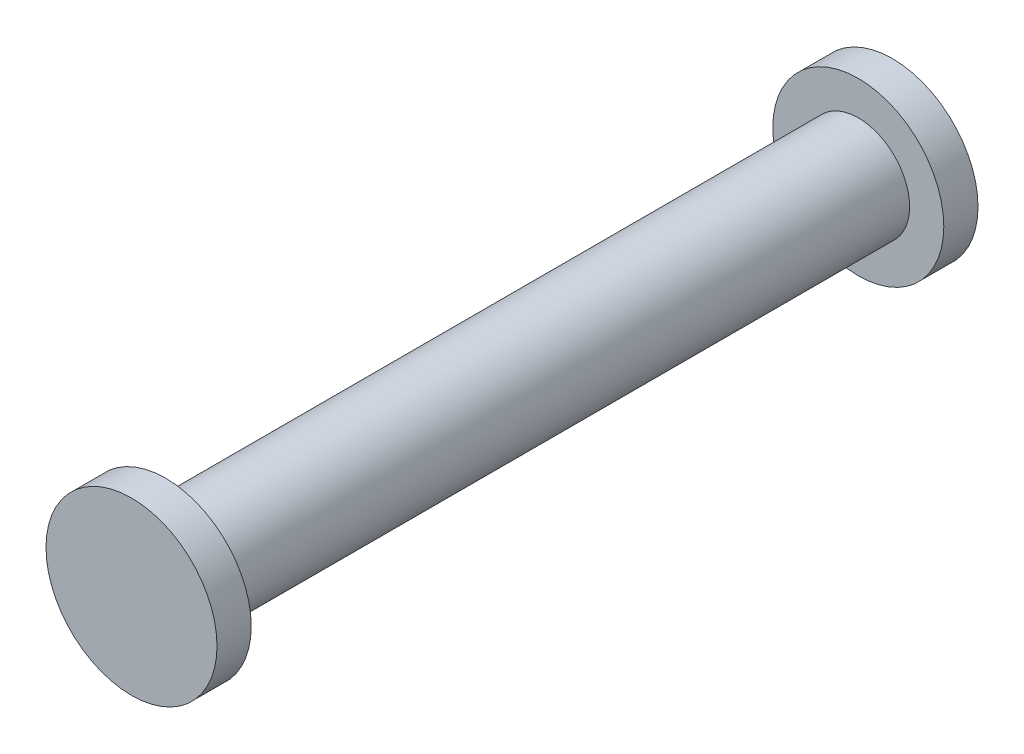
from build123d import *

# Parameters (mm, degrees)
SKETCH_1_R                 = 5
RETAINED_PIN_D6_DEPTH      = 22.25
SKETCH_2_R                 = 5.1
SKETCH_2_R_2               = 3
SHAFT_D6_ENDCAPS_D10_DEPTH = 20.25


with BuildPart() as part:
    # Sketch 1 → Retained_Pin_D6 (new, symmetric)
    with BuildSketch(Plane.XY):
        Circle(SKETCH_1_R)
    extrude(amount=RETAINED_PIN_D6_DEPTH, both=True)

    # Sketch 2 → Shaft_D6_EndCaps_D10 (cut, symmetric)
    with BuildSketch(Plane.XY):
        Circle(SKETCH_2_R)
        Circle(SKETCH_2_R_2, mode=Mode.SUBTRACT)
    extrude(amount=SHAFT_D6_ENDCAPS_D10_DEPTH, both=True, mode=Mode.SUBTRACT)


solid = part.part
